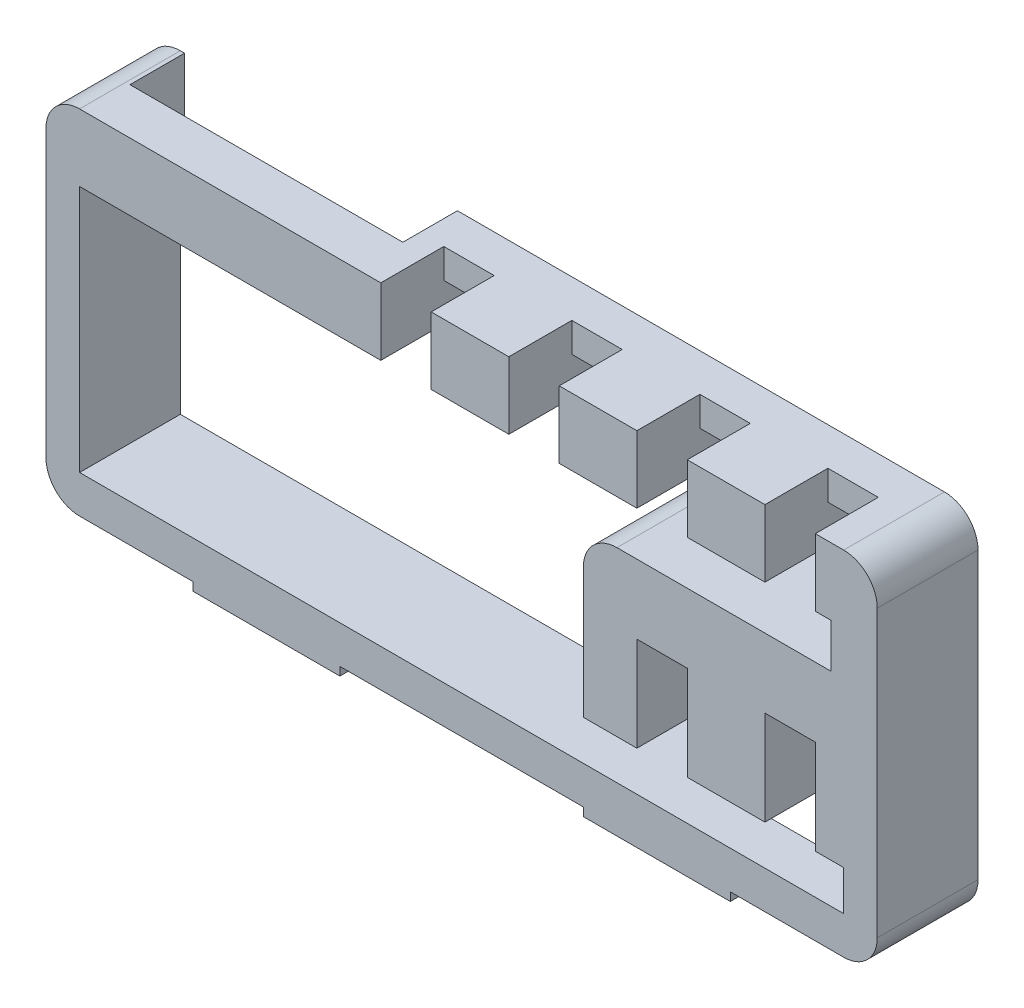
from build123d import *

# Parameters (mm, degrees)
SKETCH1_W           = 39.6
SKETCH1_H           = 16.8
SKETCH1_W_2         = 36.4
SKETCH1_H_2         = 11.8
BOSS_EXTRUDE1_DEPTH = 4.8
SKETCH2_W           = 12.4
SKETCH2_H           = 3.2
BOSS_EXTRUDE2_DEPTH = 4.8
SKETCH3_W           = 12.4
SKETCH3_H           = 4.6
BOSS_EXTRUDE3_DEPTH = 4.8
SKETCH4_W           = 2.4
SKETCH4_H           = 1.8
CUT_EXTRUDE1_DEPTH  = 4.8
FILLET1_R           = 1.6
SKETCH5_W           = 8
SKETCH5_H           = 2.6
CUT_EXTRUDE2_DEPTH  = 1.8
SKETCH6_W           = 13
SKETCH6_H           = 2.6
CUT_EXTRUDE3_DEPTH  = 3.2
SKETCH7_W           = 2.4
SKETCH7_H           = 3
CUT_EXTRUDE4_DEPTH  = 3
SKETCH8_W           = 2.4
SKETCH8_H           = 2.7
CUT_EXTRUDE5_DEPTH  = 5
FILLET2_R           = 1.6
BOSS_EXTRUDE5_REACH = 44.56
SKETCH10_W          = 7
SKETCH10_H          = 0.4
SKETCH11_W          = 0.6
SKETCH11_H          = 2.1
BOSS_EXTRUDE6_DEPTH = 4.8
SKETCH12_W          = 2.8
SKETCH12_H          = 0.4
CUT_EXTRUDE6_DEPTH  = 2.6


with BuildPart() as part:
    # Sketch1 → Boss-Extrude1 (new body)
    with BuildSketch(Plane.XY):
        with Locations((-19.963182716, -5.994032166)):
            Rectangle(SKETCH1_W, SKETCH1_H)
        with Locations((-19.963182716, -6.694032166)):
            Rectangle(SKETCH1_W_2, SKETCH1_H_2, mode=Mode.SUBTRACT)
    extrude(amount=BOSS_EXTRUDE1_DEPTH)

    # Sketch2 → Boss-Extrude2 (add)
    with BuildSketch(Plane.XY):
        with Locations((-7.963182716, -9.094032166)):
            Rectangle(SKETCH2_W, SKETCH2_H)
    extrude(amount=BOSS_EXTRUDE2_DEPTH)

    # Sketch3 → Boss-Extrude3 (add)
    with BuildSketch(Plane.XY):
        with Locations((-7.963182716, -5.194032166)):
            Rectangle(SKETCH3_W, SKETCH3_H)
    extrude(amount=BOSS_EXTRUDE3_DEPTH)

    # Sketch4 → Cut-Extrude1 (cut)
    with BuildSketch(Plane.XY):
        with Locations((-22.613182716, 0.105967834)):
            Rectangle(SKETCH4_W, SKETCH4_H)
        with Locations((-16.513182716, 0.105967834)):
            Rectangle(SKETCH4_W, SKETCH4_H)
        with Locations((-10.413182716, 0.105967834)):
            Rectangle(SKETCH4_W, SKETCH4_H)
        with Locations((-4.313182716, 0.105967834)):
            Rectangle(SKETCH4_W, SKETCH4_H)
        with Locations((-10.413182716, -9.794032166)):
            Rectangle(SKETCH4_W, SKETCH4_H)
        with Locations((-4.313182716, -9.794032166)):
            Rectangle(SKETCH4_W, SKETCH4_H)
    extrude(amount=CUT_EXTRUDE1_DEPTH, mode=Mode.SUBTRACT)

    # Fillet1
    fillet1_edges = [part.edges().sort_by_distance(p)[0] for p in [
        (-39.763182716, 2.405967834, 2.4),
        (-0.163182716, 2.405967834, 2.4),
        (-0.163182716, -14.394032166, 2.4),
        (-39.763182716, -14.394032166, 2.4),
    ]]
    fillet(fillet1_edges, radius=FILLET1_R)

    # Sketch5 → Cut-Extrude2 (cut)
    with BuildSketch(Plane(origin=(0, -14.394032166, 0), x_dir=(-1, 0, 0), z_dir=(0, -1, 0))):
        with Locations((5.963182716, -1.3)):
            Rectangle(SKETCH5_W, SKETCH5_H)
    extrude(amount=-CUT_EXTRUDE2_DEPTH, mode=Mode.SUBTRACT)

    # Sketch6 → Cut-Extrude3 (cut)
    with BuildSketch(Plane(origin=(0, 2.405967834, 0), x_dir=(1, 0, 0), z_dir=(0, 1, 0))):
        with Locations((-31.463182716, -1.3)):
            Rectangle(SKETCH6_W, SKETCH6_H)
    extrude(amount=-CUT_EXTRUDE3_DEPTH, mode=Mode.SUBTRACT)

    # Sketch7 → Cut-Extrude4 (cut)
    with BuildSketch(Plane(origin=(0, 2.405967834, 0), x_dir=(1, 0, 0), z_dir=(0, 1, 0))):
        with Locations((-22.613182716, -3.3)):
            Rectangle(SKETCH7_W, SKETCH7_H)
        with Locations((-16.513182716, -3.3)):
            Rectangle(SKETCH7_W, SKETCH7_H)
        with Locations((-10.413182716, -3.3)):
            Rectangle(SKETCH7_W, SKETCH7_H)
        with Locations((-4.313182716, -3.3)):
            Rectangle(SKETCH7_W, SKETCH7_H)
    extrude(amount=-CUT_EXTRUDE4_DEPTH, mode=Mode.SUBTRACT)

    # Sketch8 → Cut-Extrude5 (cut)
    with BuildSketch(Plane.XY):
        with Locations((-10.413182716, -7.544032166)):
            Rectangle(SKETCH8_W, SKETCH8_H)
        with Locations((-4.313182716, -7.544032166)):
            Rectangle(SKETCH8_W, SKETCH8_H)
    extrude(amount=CUT_EXTRUDE5_DEPTH, mode=Mode.SUBTRACT)

    # Fillet2
    fillet2_edges = [part.edges().sort_by_distance(p)[0] for p in [
        (-14.163182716, -2.894032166, 2.4),
    ]]
    fillet(fillet2_edges, radius=FILLET2_R)

    # Boss-Extrude5: up to this face of the body (flat: up to its plane)
    boss_extrude5_end = Plane(part.part.faces().sort_by_distance((-13.733019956, -7.594032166, 4.8))[0])
    # Sketch10 → Boss-Extrude5 (add, up to the picked face)
    with BuildSketch(Plane.XY, mode=Mode.PRIVATE) as boss_extrude5_sk1:
        with Locations((-10.663182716, -14.594032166)):
            Rectangle(SKETCH10_W, SKETCH10_H)
    boss_extrude5_tool1 = split(extrude(boss_extrude5_sk1.sketch, amount=BOSS_EXTRUDE5_REACH, mode=Mode.PRIVATE), bisect_by=boss_extrude5_end, keep=Keep.BOTH, mode=Mode.PRIVATE)
    # Sketch10 → Boss-Extrude5 (add, up to the picked face)
    with BuildSketch(Plane.XY, mode=Mode.PRIVATE) as boss_extrude5_sk2:
        with Locations((-29.263182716, -14.594032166)):
            Rectangle(SKETCH10_W, SKETCH10_H)
    boss_extrude5_tool2 = split(extrude(boss_extrude5_sk2.sketch, amount=BOSS_EXTRUDE5_REACH, mode=Mode.PRIVATE), bisect_by=boss_extrude5_end, keep=Keep.BOTH, mode=Mode.PRIVATE)
    add(boss_extrude5_tool1.solids().sort_by(Axis((-10.663183, -14.594032, 0), (0, 0, 1)))[0])
    add(boss_extrude5_tool2.solids().sort_by(Axis((-29.263183, -14.594032, 0), (0, 0, 1)))[0])

    # Sketch11 → Boss-Extrude6 (add)
    with BuildSketch(Plane.XY):
        with Locations((-2.063182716, -1.844032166)):
            Rectangle(SKETCH11_W, SKETCH11_H)
    extrude(amount=BOSS_EXTRUDE6_DEPTH)

    # Sketch12 → Cut-Extrude6 (cut)
    with BuildSketch(Plane.XY):
        with Locations((-8.563182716, -14.594032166)):
            Rectangle(SKETCH12_W, SKETCH12_H)
    extrude(amount=CUT_EXTRUDE6_DEPTH, mode=Mode.SUBTRACT)


solid = part.part
